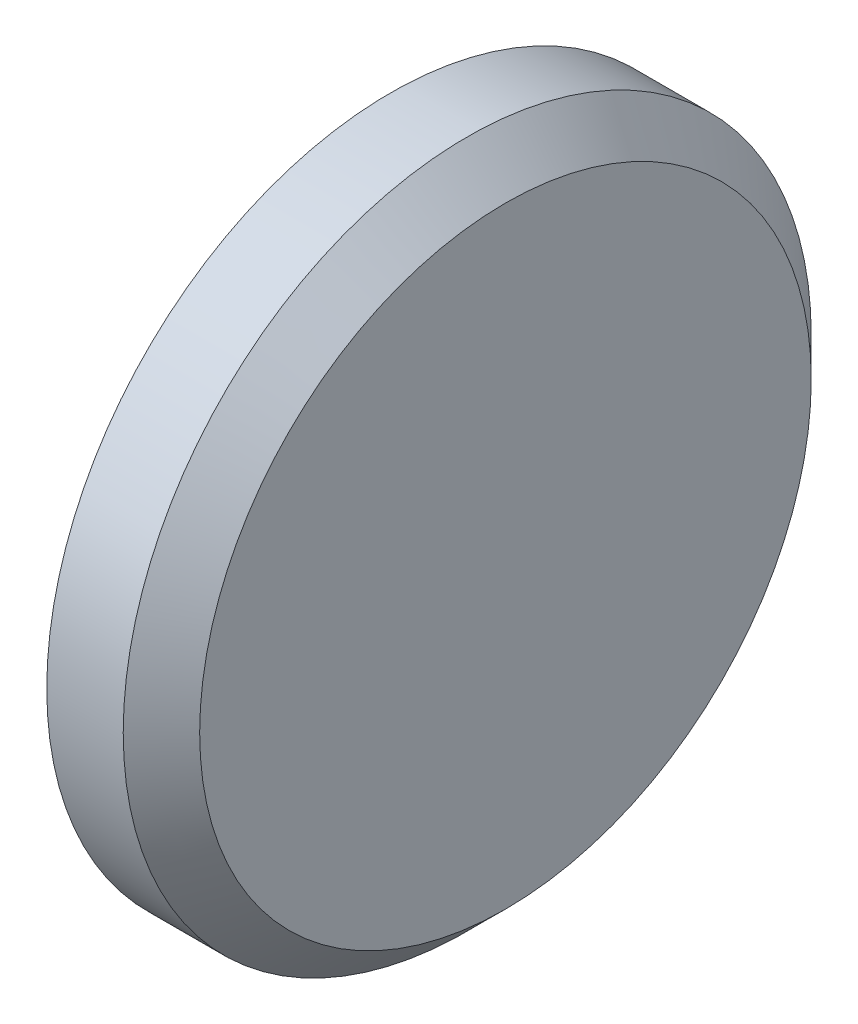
from build123d import *

# Parameters (mm, degrees)
SKETCH1_R           = 9
BOSS_EXTRUDE1_DEPTH = 3
CHAMFER1_SIZE       = 1


with BuildPart() as part:
    # Sketch1 → Boss-Extrude1 (new body)
    with BuildSketch(Plane(origin=(0, 0, 0), x_dir=(0, 0, -1), z_dir=(1, 0, 0))):
        Circle(SKETCH1_R)
    extrude(amount=BOSS_EXTRUDE1_DEPTH)

    # Chamfer1
    chamfer1_edges = [part.edges().sort_by_distance(p)[0] for p in [
        (3, 0, 9),
    ]]
    chamfer(chamfer1_edges, length=CHAMFER1_SIZE)


solid = part.part
